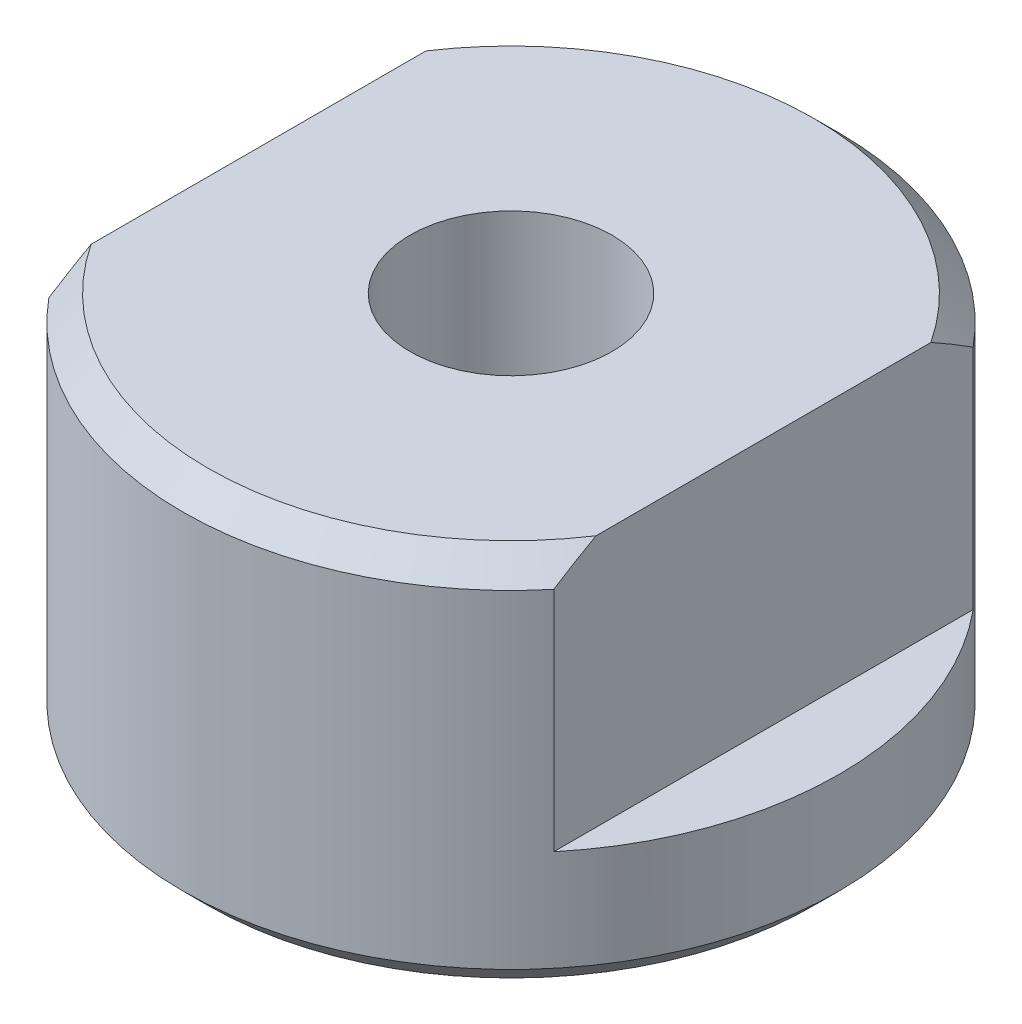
ISO-10303-21;
HEADER;
FILE_DESCRIPTION(('STEP AP214'),'2;1');
FILE_NAME('part.step','',(''),(''),'','','');
FILE_SCHEMA(('AUTOMOTIVE_DESIGN { 1 0 10303 214 1 1 1 1 }'));
ENDSEC;
DATA;
#1=APPLICATION_CONTEXT('core data for automotive mechanical design processes');
#2=APPLICATION_PROTOCOL_DEFINITION('international standard','automotive_design',2000,#1);
#3=PRODUCT_CONTEXT('',#1,'mechanical');
#4=PRODUCT('Part','Part','',(#3));
#5=PRODUCT_RELATED_PRODUCT_CATEGORY('part','',(#4));
#6=PRODUCT_DEFINITION_FORMATION('','',#4);
#7=PRODUCT_DEFINITION_CONTEXT('part definition',#1,'design');
#8=PRODUCT_DEFINITION('design','',#6,#7);
#9=PRODUCT_DEFINITION_SHAPE('','',#8);
#10=(LENGTH_UNIT() NAMED_UNIT(*) SI_UNIT(.MILLI.,.METRE.));
#11=(NAMED_UNIT(*) PLANE_ANGLE_UNIT() SI_UNIT($,.RADIAN.));
#12=(NAMED_UNIT(*) SI_UNIT($,.STERADIAN.) SOLID_ANGLE_UNIT());
#13=UNCERTAINTY_MEASURE_WITH_UNIT(LENGTH_MEASURE(1.E-05),#10,'distance_accuracy_value','');
#14=(GEOMETRIC_REPRESENTATION_CONTEXT(3) GLOBAL_UNCERTAINTY_ASSIGNED_CONTEXT((#13)) GLOBAL_UNIT_ASSIGNED_CONTEXT((#10,
#11,#12)) REPRESENTATION_CONTEXT('',''));
#15=CARTESIAN_POINT('',(0.,0.,0.));
#16=DIRECTION('',(0.,0.,1.));
#17=DIRECTION('',(1.,0.,0.));
#18=AXIS2_PLACEMENT_3D('',#15,#16,#17);
#19=CARTESIAN_POINT('',(56.,-2.59999999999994,1.65));
#20=DIRECTION('',(0.,-1.,0.));
#21=DIRECTION('',(0.,0.,-1.));
#22=AXIS2_PLACEMENT_3D('',#19,#20,#21);
#23=CONICAL_SURFACE('',#22,2.6,0.785398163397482);
#24=CARTESIAN_POINT('',(54.,-4.16968255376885,5.30872280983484));
#25=CARTESIAN_POINT('',(54.,-4.07553205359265,5.20138421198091));
#26=CARTESIAN_POINT('',(54.,-3.98187869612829,5.09360097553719));
#27=CARTESIAN_POINT('',(54.,-3.79592223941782,4.876795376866));
#28=CARTESIAN_POINT('',(54.,-3.70361974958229,4.76777249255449));
#29=CARTESIAN_POINT('',(54.,-3.51901631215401,4.54608422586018));
#30=CARTESIAN_POINT('',(54.,-3.42675070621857,4.43338930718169));
#31=CARTESIAN_POINT('',(54.,-3.24476216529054,4.20600054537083));
#32=CARTESIAN_POINT('',(54.,-3.15503861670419,4.09130719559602));
#33=CARTESIAN_POINT('',(54.,-2.97901219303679,3.8591314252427));
#34=CARTESIAN_POINT('',(54.,-2.89271276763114,3.74164637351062));
#35=CARTESIAN_POINT('',(54.,-2.72512031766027,3.502976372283));
#36=CARTESIAN_POINT('',(54.,-2.64383124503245,3.38178861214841));
#37=CARTESIAN_POINT('',(54.,-2.48934435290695,3.13527397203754));
#38=CARTESIAN_POINT('',(54.,-2.41610274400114,3.00997486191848));
#39=CARTESIAN_POINT('',(54.,-2.28145924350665,2.75317123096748));
#40=CARTESIAN_POINT('',(54.,-2.22003710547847,2.62167781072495));
#41=CARTESIAN_POINT('',(54.,-2.14123847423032,2.41742619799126));
#42=CARTESIAN_POINT('',(54.,-2.11699806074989,2.34733288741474));
#43=CARTESIAN_POINT('',(54.,-2.07455687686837,2.20531742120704));
#44=CARTESIAN_POINT('',(54.,-2.05635516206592,2.13339555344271));
#45=CARTESIAN_POINT('',(54.,-2.02723942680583,1.98864167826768));
#46=CARTESIAN_POINT('',(54.,-2.01627012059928,1.91582101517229));
#47=CARTESIAN_POINT('',(54.,-2.0022380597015,1.76941657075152));
#48=CARTESIAN_POINT('',(54.,-1.9991738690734,1.69583293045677));
#49=CARTESIAN_POINT('',(54.,-2.00121401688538,1.54845938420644));
#50=CARTESIAN_POINT('',(54.,-2.00635415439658,1.47466998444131));
#51=CARTESIAN_POINT('',(54.,-2.02443707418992,1.32805953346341));
#52=CARTESIAN_POINT('',(54.,-2.03738167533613,1.25523871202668));
#53=CARTESIAN_POINT('',(54.,-2.07025452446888,1.11059020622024));
#54=CARTESIAN_POINT('',(54.,-2.09023951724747,1.03877567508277));
#55=CARTESIAN_POINT('',(54.,-2.13598816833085,0.897039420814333));
#56=CARTESIAN_POINT('',(54.,-2.16175219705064,0.827117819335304));
#57=CARTESIAN_POINT('',(54.,-2.22233429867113,0.678358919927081));
#58=CARTESIAN_POINT('',(54.,-2.25793879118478,0.599845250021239));
#59=CARTESIAN_POINT('',(54.,-2.33391268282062,0.445138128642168));
#60=CARTESIAN_POINT('',(54.,-2.37428472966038,0.368945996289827));
#61=CARTESIAN_POINT('',(54.,-2.45874054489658,0.218466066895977));
#62=CARTESIAN_POINT('',(54.,-2.50283150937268,0.144182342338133));
#63=CARTESIAN_POINT('',(54.,-2.59380849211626,-0.00262172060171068));
#64=CARTESIAN_POINT('',(54.,-2.64069397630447,-0.0751423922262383));
#65=CARTESIAN_POINT('',(54.,-2.73691638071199,-0.219115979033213));
#66=CARTESIAN_POINT('',(54.,-2.78626548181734,-0.29056071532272));
#67=CARTESIAN_POINT('',(54.,-2.88671424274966,-0.432211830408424));
#68=CARTESIAN_POINT('',(54.,-2.93781403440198,-0.502418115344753));
#69=CARTESIAN_POINT('',(54.,-3.09307406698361,-0.711318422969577));
#70=CARTESIAN_POINT('',(54.,-3.19931228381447,-0.848465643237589));
#71=CARTESIAN_POINT('',(54.,-3.44738497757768,-1.15994024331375));
#72=CARTESIAN_POINT('',(54.,-3.59045776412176,-1.3332727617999));
#73=CARTESIAN_POINT('',(54.,-3.80700708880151,-1.5896477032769));
#74=CARTESIAN_POINT('',(54.,-3.87901711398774,-1.67394045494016));
#75=CARTESIAN_POINT('',(54.,-4.02380657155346,-1.84182232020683));
#76=CARTESIAN_POINT('',(54.,-4.09658578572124,-1.92541162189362));
#77=CARTESIAN_POINT('',(54.,-4.16968255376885,-2.00872280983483));
#78=B_SPLINE_CURVE_WITH_KNOTS('',3,(#24,#25,#26,#27,#28,#29,#30,#31,#32,#33,#34,#35,#36,#37,#38,
#39,#40,#41,#42,#43,#44,#45,#46,#47,#48,#49,#50,#51,#52,#53,#54,#55,#56,#57,#58,#59,#60,#61,#62,
#63,#64,#65,#66,#67,#68,#69,#70,#71,#72,#73,#74,#75,#76,#77),.UNSPECIFIED.,.F.,.F.,(4,2,2,2,2,2,
2,2,2,2,2,2,2,2,2,2,2,2,2,2,2,2,2,2,2,2,4),(0.,0.428345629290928,0.856878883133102,
1.29379390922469,1.73060255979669,2.16784064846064,2.60541930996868,3.04048480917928,
3.47479828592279,3.69708380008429,3.9193345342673,4.13986601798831,4.36035744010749,
4.58181359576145,4.80332138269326,5.02665696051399,5.25000685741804,5.50842088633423,
5.76697910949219,6.02604965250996,6.28507084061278,6.54553222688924,6.80601326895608,
7.32635191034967,8.0005201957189,8.33310775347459,8.66560336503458),.UNSPECIFIED.);
#79=CARTESIAN_POINT('',(54.,-2.59999999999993,3.31132477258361));
#80=VERTEX_POINT('',#79);
#81=CARTESIAN_POINT('',(54.,-2.3999999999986,2.97664991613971));
#82=VERTEX_POINT('',#81);
#83=EDGE_CURVE('E11',#80,#82,#78,.T.);
#84=ORIENTED_EDGE('',*,*,#83,.F.);
#85=CARTESIAN_POINT('',(56.,-2.59999999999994,1.65));
#86=DIRECTION('',(0.,1.,0.));
#87=DIRECTION('',(0.,0.,1.));
#88=AXIS2_PLACEMENT_3D('',#85,#86,#87);
#89=CIRCLE('',#88,2.6);
#90=CARTESIAN_POINT('',(58.,-2.59999999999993,3.31132477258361));
#91=VERTEX_POINT('',#90);
#92=EDGE_CURVE('E111',#91,#80,#89,.F.);
#93=ORIENTED_EDGE('',*,*,#92,.F.);
#94=CARTESIAN_POINT('',(58.,-4.16968255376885,-2.00872280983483));
#95=CARTESIAN_POINT('',(58.,-4.07553205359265,-1.90138421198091));
#96=CARTESIAN_POINT('',(58.,-3.98187869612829,-1.79360097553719));
#97=CARTESIAN_POINT('',(58.,-3.79592223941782,-1.576795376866));
#98=CARTESIAN_POINT('',(58.,-3.70361974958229,-1.46777249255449));
#99=CARTESIAN_POINT('',(58.,-3.51901631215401,-1.24608422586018));
#100=CARTESIAN_POINT('',(58.,-3.42675070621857,-1.13338930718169));
#101=CARTESIAN_POINT('',(58.,-3.24476216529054,-0.906000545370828));
#102=CARTESIAN_POINT('',(58.,-3.15503861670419,-0.79130719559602));
#103=CARTESIAN_POINT('',(58.,-2.97901219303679,-0.559131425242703));
#104=CARTESIAN_POINT('',(58.,-2.89271276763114,-0.441646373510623));
#105=CARTESIAN_POINT('',(58.,-2.72512031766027,-0.202976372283));
#106=CARTESIAN_POINT('',(58.,-2.64383124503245,-0.081788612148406));
#107=CARTESIAN_POINT('',(58.,-2.48934435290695,0.164726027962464));
#108=CARTESIAN_POINT('',(58.,-2.41610274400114,0.290025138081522));
#109=CARTESIAN_POINT('',(58.,-2.28145924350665,0.546828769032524));
#110=CARTESIAN_POINT('',(58.,-2.22003710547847,0.678322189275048));
#111=CARTESIAN_POINT('',(58.,-2.14123847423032,0.882573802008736));
#112=CARTESIAN_POINT('',(58.,-2.11699806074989,0.952667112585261));
#113=CARTESIAN_POINT('',(58.,-2.07455687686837,1.09468257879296));
#114=CARTESIAN_POINT('',(58.,-2.05635516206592,1.16660444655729));
#115=CARTESIAN_POINT('',(58.,-2.02723942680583,1.31135832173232));
#116=CARTESIAN_POINT('',(58.,-2.01627012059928,1.38417898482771));
#117=CARTESIAN_POINT('',(58.,-2.0022380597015,1.53058342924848));
#118=CARTESIAN_POINT('',(58.,-1.9991738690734,1.60416706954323));
#119=CARTESIAN_POINT('',(58.,-2.00121401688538,1.75154061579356));
#120=CARTESIAN_POINT('',(58.,-2.00635415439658,1.82533001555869));
#121=CARTESIAN_POINT('',(58.,-2.02443707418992,1.97194046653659));
#122=CARTESIAN_POINT('',(58.,-2.03738167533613,2.04476128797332));
#123=CARTESIAN_POINT('',(58.,-2.07025452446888,2.18940979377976));
#124=CARTESIAN_POINT('',(58.,-2.09023951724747,2.26122432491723));
#125=CARTESIAN_POINT('',(58.,-2.13598816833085,2.40296057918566));
#126=CARTESIAN_POINT('',(58.,-2.16175219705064,2.47288218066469));
#127=CARTESIAN_POINT('',(58.,-2.22233429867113,2.62164108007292));
#128=CARTESIAN_POINT('',(58.,-2.25793879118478,2.70015474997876));
#129=CARTESIAN_POINT('',(58.,-2.33391268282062,2.85486187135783));
#130=CARTESIAN_POINT('',(58.,-2.37428472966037,2.93105400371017));
#131=CARTESIAN_POINT('',(58.,-2.45874054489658,3.08153393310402));
#132=CARTESIAN_POINT('',(58.,-2.50283150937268,3.15581765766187));
#133=CARTESIAN_POINT('',(58.,-2.59380849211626,3.30262172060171));
#134=CARTESIAN_POINT('',(58.,-2.64069397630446,3.37514239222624));
#135=CARTESIAN_POINT('',(58.,-2.73691638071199,3.51911597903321));
#136=CARTESIAN_POINT('',(58.,-2.78626548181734,3.59056071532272));
#137=CARTESIAN_POINT('',(58.,-2.88671424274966,3.73221183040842));
#138=CARTESIAN_POINT('',(58.,-2.93781403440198,3.80241811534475));
#139=CARTESIAN_POINT('',(58.,-3.09307406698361,4.01131842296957));
#140=CARTESIAN_POINT('',(58.,-3.19931228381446,4.14846564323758));
#141=CARTESIAN_POINT('',(58.,-3.44738497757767,4.45994024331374));
#142=CARTESIAN_POINT('',(58.,-3.59045776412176,4.6332727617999));
#143=CARTESIAN_POINT('',(58.,-3.80700708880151,4.8896477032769));
#144=CARTESIAN_POINT('',(58.,-3.87901711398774,4.97394045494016));
#145=CARTESIAN_POINT('',(58.,-4.02380657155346,5.14182232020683));
#146=CARTESIAN_POINT('',(58.,-4.09658578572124,5.22541162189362));
#147=CARTESIAN_POINT('',(58.,-4.16968255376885,5.30872280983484));
#148=B_SPLINE_CURVE_WITH_KNOTS('',3,(#94,#95,#96,#97,#98,#99,#100,#101,#102,#103,#104,#105,#106,
#107,#108,#109,#110,#111,#112,#113,#114,#115,#116,#117,#118,#119,#120,#121,#122,#123,#124,#125,
#126,#127,#128,#129,#130,#131,#132,#133,#134,#135,#136,#137,#138,#139,#140,#141,#142,#143,#144,
#145,#146,#147),.UNSPECIFIED.,.F.,.F.,(4,2,2,2,2,2,2,2,2,2,2,2,2,2,2,2,2,2,2,2,2,2,2,2,2,2,4),
(0.,0.428345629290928,0.856878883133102,1.29379390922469,1.73060255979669,2.16784064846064,
2.60541930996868,3.04048480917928,3.47479828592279,3.69708380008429,3.9193345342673,
4.1398660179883,4.36035744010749,4.58181359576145,4.80332138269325,5.02665696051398,
5.25000685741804,5.50842088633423,5.76697910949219,6.02604965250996,6.28507084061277,
6.54553222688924,6.80601326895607,7.32635191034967,8.0005201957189,8.33310775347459,
8.66560336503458),.UNSPECIFIED.);
#149=CARTESIAN_POINT('',(58.,-2.3999999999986,2.97664991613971));
#150=VERTEX_POINT('',#149);
#151=EDGE_CURVE('E146',#150,#91,#148,.T.);
#152=ORIENTED_EDGE('',*,*,#151,.F.);
#153=CARTESIAN_POINT('',(56.,-2.3999999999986,1.65));
#154=DIRECTION('',(0.,1.,0.));
#155=DIRECTION('',(0.,0.,1.));
#156=AXIS2_PLACEMENT_3D('',#153,#154,#155);
#157=CIRCLE('',#156,2.39999999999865);
#158=EDGE_CURVE('E143',#82,#150,#157,.T.);
#159=ORIENTED_EDGE('',*,*,#158,.F.);
#160=EDGE_LOOP('',(#84,#93,#152,#159));
#161=FACE_BOUND('',#160,.T.);
#162=ADVANCED_FACE('F35',(#161),#23,.T.);
#163=CARTESIAN_POINT('',(58.6,-5.4,1.65));
#164=DIRECTION('',(0.,-1.,0.));
#165=DIRECTION('',(0.,0.,-1.));
#166=AXIS2_PLACEMENT_3D('',#163,#164,#165);
#167=PLANE('',#166);
#168=CARTESIAN_POINT('',(56.,-5.4,1.65));
#169=DIRECTION('',(0.,-1.,0.));
#170=DIRECTION('',(0.,0.,-1.));
#171=AXIS2_PLACEMENT_3D('',#168,#169,#170);
#172=CIRCLE('',#171,2.40000000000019);
#173=CARTESIAN_POINT('',(56.,-5.4,4.05000000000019));
#174=VERTEX_POINT('',#173);
#175=EDGE_CURVE('E135',#174,#174,#172,.T.);
#176=ORIENTED_EDGE('',*,*,#175,.T.);
#177=EDGE_LOOP('',(#176));
#178=FACE_BOUND('',#177,.T.);
#179=CARTESIAN_POINT('',(56.,-5.4,1.65));
#180=DIRECTION('',(0.,-1.,0.));
#181=DIRECTION('',(0.,0.,-1.));
#182=AXIS2_PLACEMENT_3D('',#179,#180,#181);
#183=CIRCLE('',#182,1.025);
#184=CARTESIAN_POINT('',(56.,-5.4,0.625000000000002));
#185=VERTEX_POINT('',#184);
#186=EDGE_CURVE('E113',#185,#185,#183,.T.);
#187=ORIENTED_EDGE('',*,*,#186,.F.);
#188=EDGE_LOOP('',(#187));
#189=FACE_BOUND('',#188,.T.);
#190=ADVANCED_FACE('F174',(#178,#189),#167,.T.);
#191=CARTESIAN_POINT('',(56.,-1065.45754338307,1.65));
#192=DIRECTION('',(0.,-1.,0.));
#193=DIRECTION('',(0.,0.,-1.));
#194=AXIS2_PLACEMENT_3D('',#191,#192,#193);
#195=CYLINDRICAL_SURFACE('',#194,2.6);
#196=DIRECTION('',(0.,1.,0.));
#197=VECTOR('',#196,1.);
#198=CARTESIAN_POINT('',(54.,-4.3999999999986,3.31132477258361));
#199=LINE('',#198,#197);
#200=CARTESIAN_POINT('',(54.,-4.3999999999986,3.31132477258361));
#201=VERTEX_POINT('',#200);
#202=EDGE_CURVE('E102',#201,#80,#199,.T.);
#203=ORIENTED_EDGE('',*,*,#202,.F.);
#204=CARTESIAN_POINT('',(56.,-4.3999999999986,1.65));
#205=DIRECTION('',(0.,1.,0.));
#206=DIRECTION('',(0.,0.,1.));
#207=AXIS2_PLACEMENT_3D('',#204,#205,#206);
#208=CIRCLE('',#207,2.6);
#209=CARTESIAN_POINT('',(54.,-4.3999999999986,-0.0113247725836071));
#210=VERTEX_POINT('',#209);
#211=EDGE_CURVE('E93',#210,#201,#208,.T.);
#212=ORIENTED_EDGE('',*,*,#211,.F.);
#213=DIRECTION('',(0.,1.,0.));
#214=VECTOR('',#213,1.);
#215=CARTESIAN_POINT('',(54.,-4.3999999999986,-0.0113247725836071));
#216=LINE('',#215,#214);
#217=CARTESIAN_POINT('',(54.,-2.59999999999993,-0.0113247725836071));
#218=VERTEX_POINT('',#217);
#219=EDGE_CURVE('E104',#210,#218,#216,.T.);
#220=ORIENTED_EDGE('',*,*,#219,.T.);
#221=CARTESIAN_POINT('',(58.,-2.59999999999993,-0.0113247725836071));
#222=VERTEX_POINT('',#221);
#223=EDGE_CURVE('E139',#218,#222,#89,.F.);
#224=ORIENTED_EDGE('',*,*,#223,.T.);
#225=DIRECTION('',(0.,1.,0.));
#226=VECTOR('',#225,1.);
#227=CARTESIAN_POINT('',(58.,-4.3999999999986,-0.0113247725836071));
#228=LINE('',#227,#226);
#229=CARTESIAN_POINT('',(58.,-4.3999999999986,-0.0113247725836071));
#230=VERTEX_POINT('',#229);
#231=EDGE_CURVE('E122',#230,#222,#228,.T.);
#232=ORIENTED_EDGE('',*,*,#231,.F.);
#233=CARTESIAN_POINT('',(56.,-4.3999999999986,1.65));
#234=DIRECTION('',(0.,1.,0.));
#235=DIRECTION('',(0.,0.,1.));
#236=AXIS2_PLACEMENT_3D('',#233,#234,#235);
#237=CIRCLE('',#236,2.6);
#238=CARTESIAN_POINT('',(58.,-4.3999999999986,3.31132477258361));
#239=VERTEX_POINT('',#238);
#240=EDGE_CURVE('E117',#239,#230,#237,.T.);
#241=ORIENTED_EDGE('',*,*,#240,.F.);
#242=DIRECTION('',(0.,1.,0.));
#243=VECTOR('',#242,1.);
#244=CARTESIAN_POINT('',(58.,-4.3999999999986,3.31132477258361));
#245=LINE('',#244,#243);
#246=EDGE_CURVE('E124',#239,#91,#245,.T.);
#247=ORIENTED_EDGE('',*,*,#246,.T.);
#248=ORIENTED_EDGE('',*,*,#92,.T.);
#249=EDGE_LOOP('',(#203,#212,#220,#224,#232,#241,#247,#248));
#250=FACE_BOUND('',#249,.T.);
#251=CARTESIAN_POINT('',(56.,-5.20000000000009,1.65));
#252=DIRECTION('',(0.,-1.,0.));
#253=DIRECTION('',(0.,0.,-1.));
#254=AXIS2_PLACEMENT_3D('',#251,#252,#253);
#255=CIRCLE('',#254,2.6);
#256=CARTESIAN_POINT('',(56.,-5.20000000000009,4.25));
#257=VERTEX_POINT('',#256);
#258=EDGE_CURVE('E140',#257,#257,#255,.F.);
#259=ORIENTED_EDGE('',*,*,#258,.T.);
#260=EDGE_LOOP('',(#259));
#261=FACE_BOUND('',#260,.T.);
#262=ADVANCED_FACE('F107',(#250,#261),#195,.T.);
#263=CARTESIAN_POINT('',(58.6,-2.3999999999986,1.65));
#264=DIRECTION('',(0.,1.,0.));
#265=DIRECTION('',(0.,0.,1.));
#266=AXIS2_PLACEMENT_3D('',#263,#264,#265);
#267=PLANE('',#266);
#268=DIRECTION('',(0.,0.,-1.));
#269=VECTOR('',#268,1.);
#270=CARTESIAN_POINT('',(54.,-2.3999999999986,-0.0113247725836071));
#271=LINE('',#270,#269);
#272=CARTESIAN_POINT('',(54.,-2.3999999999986,0.323350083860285));
#273=VERTEX_POINT('',#272);
#274=EDGE_CURVE('E55',#82,#273,#271,.T.);
#275=ORIENTED_EDGE('',*,*,#274,.F.);
#276=ORIENTED_EDGE('',*,*,#158,.T.);
#277=DIRECTION('',(0.,0.,1.));
#278=VECTOR('',#277,1.);
#279=CARTESIAN_POINT('',(58.,-2.3999999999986,3.31132477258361));
#280=LINE('',#279,#278);
#281=CARTESIAN_POINT('',(58.,-2.3999999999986,0.323350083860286));
#282=VERTEX_POINT('',#281);
#283=EDGE_CURVE('E63',#282,#150,#280,.T.);
#284=ORIENTED_EDGE('',*,*,#283,.F.);
#285=EDGE_CURVE('E145',#282,#273,#157,.T.);
#286=ORIENTED_EDGE('',*,*,#285,.T.);
#287=EDGE_LOOP('',(#275,#276,#284,#286));
#288=FACE_BOUND('',#287,.T.);
#289=CARTESIAN_POINT('',(56.,-2.39999999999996,1.65));
#290=DIRECTION('',(0.,-1.,0.));
#291=DIRECTION('',(0.,0.,-1.));
#292=AXIS2_PLACEMENT_3D('',#289,#290,#291);
#293=CIRCLE('',#292,0.800000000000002);
#294=CARTESIAN_POINT('',(56.,-2.39999999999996,0.849999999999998));
#295=VERTEX_POINT('',#294);
#296=EDGE_CURVE('E132',#295,#295,#293,.T.);
#297=ORIENTED_EDGE('',*,*,#296,.T.);
#298=EDGE_LOOP('',(#297));
#299=FACE_BOUND('',#298,.T.);
#300=ADVANCED_FACE('F167',(#288,#299),#267,.T.);
#301=CARTESIAN_POINT('',(56.,-5.4,1.65));
#302=DIRECTION('',(0.,-1.,0.));
#303=DIRECTION('',(0.,0.,-1.));
#304=AXIS2_PLACEMENT_3D('',#301,#302,#303);
#305=CYLINDRICAL_SURFACE('',#304,0.800000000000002);
#306=ORIENTED_EDGE('',*,*,#296,.F.);
#307=EDGE_LOOP('',(#306));
#308=FACE_BOUND('',#307,.T.);
#309=CARTESIAN_POINT('',(56.,-5.175,1.65));
#310=DIRECTION('',(0.,-1.,0.));
#311=DIRECTION('',(0.,0.,-1.));
#312=AXIS2_PLACEMENT_3D('',#309,#310,#311);
#313=CIRCLE('',#312,0.800000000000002);
#314=CARTESIAN_POINT('',(56.,-5.175,0.849999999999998));
#315=VERTEX_POINT('',#314);
#316=EDGE_CURVE('E129',#315,#315,#313,.T.);
#317=ORIENTED_EDGE('',*,*,#316,.T.);
#318=EDGE_LOOP('',(#317));
#319=FACE_BOUND('',#318,.T.);
#320=ADVANCED_FACE('F163',(#308,#319),#305,.F.);
#321=CARTESIAN_POINT('',(56.,-5.4,1.65));
#322=DIRECTION('',(0.,-1.,0.));
#323=DIRECTION('',(0.,0.,-1.));
#324=AXIS2_PLACEMENT_3D('',#321,#322,#323);
#325=CONICAL_SURFACE('',#324,1.025,0.785398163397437);
#326=ORIENTED_EDGE('',*,*,#316,.F.);
#327=EDGE_LOOP('',(#326));
#328=FACE_BOUND('',#327,.T.);
#329=ORIENTED_EDGE('',*,*,#186,.T.);
#330=EDGE_LOOP('',(#329));
#331=FACE_BOUND('',#330,.T.);
#332=ADVANCED_FACE('F159',(#328,#331),#325,.F.);
#333=CARTESIAN_POINT('',(56.,-5.40000000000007,1.65));
#334=DIRECTION('',(0.,1.,0.));
#335=DIRECTION('',(0.,0.,1.));
#336=AXIS2_PLACEMENT_3D('',#333,#334,#335);
#337=CONICAL_SURFACE('',#336,2.40000000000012,0.785398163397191);
#338=CARTESIAN_POINT('',(56.,-5.20000000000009,4.25));
#339=CARTESIAN_POINT('',(56.,-5.20208333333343,4.24791666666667));
#340=CARTESIAN_POINT('',(56.,-5.20416666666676,4.24583333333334));
#341=CARTESIAN_POINT('',(56.,-5.20833333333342,4.24166666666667));
#342=CARTESIAN_POINT('',(56.,-5.21041666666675,4.23958333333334));
#343=CARTESIAN_POINT('',(56.,-5.21458333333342,4.23541666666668));
#344=CARTESIAN_POINT('',(56.,-5.21666666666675,4.23333333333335));
#345=CARTESIAN_POINT('',(56.,-5.22083333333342,4.22916666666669));
#346=CARTESIAN_POINT('',(56.,-5.22291666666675,4.22708333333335));
#347=CARTESIAN_POINT('',(56.,-5.22708333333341,4.22291666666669));
#348=CARTESIAN_POINT('',(56.,-5.22916666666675,4.22083333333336));
#349=CARTESIAN_POINT('',(56.,-5.23333333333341,4.2166666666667));
#350=CARTESIAN_POINT('',(56.,-5.23541666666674,4.21458333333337));
#351=CARTESIAN_POINT('',(56.,-5.23958333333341,4.2104166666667));
#352=CARTESIAN_POINT('',(56.,-5.24166666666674,4.20833333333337));
#353=CARTESIAN_POINT('',(56.,-5.24583333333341,4.20416666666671));
#354=CARTESIAN_POINT('',(56.,-5.24791666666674,4.20208333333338));
#355=CARTESIAN_POINT('',(56.,-5.2520833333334,4.19791666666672));
#356=CARTESIAN_POINT('',(56.,-5.25416666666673,4.19583333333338));
#357=CARTESIAN_POINT('',(56.,-5.2583333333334,4.19166666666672));
#358=CARTESIAN_POINT('',(56.,-5.26041666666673,4.18958333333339));
#359=CARTESIAN_POINT('',(56.,-5.2645833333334,4.18541666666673));
#360=CARTESIAN_POINT('',(56.,-5.26666666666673,4.1833333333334));
#361=CARTESIAN_POINT('',(56.,-5.27083333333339,4.17916666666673));
#362=CARTESIAN_POINT('',(56.,-5.27291666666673,4.1770833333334));
#363=CARTESIAN_POINT('',(56.,-5.27708333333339,4.17291666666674));
#364=CARTESIAN_POINT('',(56.,-5.27916666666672,4.17083333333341));
#365=CARTESIAN_POINT('',(56.,-5.28333333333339,4.16666666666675));
#366=CARTESIAN_POINT('',(56.,-5.28541666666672,4.16458333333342));
#367=CARTESIAN_POINT('',(56.,-5.28958333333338,4.16041666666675));
#368=CARTESIAN_POINT('',(56.,-5.29166666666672,4.15833333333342));
#369=CARTESIAN_POINT('',(56.,-5.29583333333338,4.15416666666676));
#370=CARTESIAN_POINT('',(56.,-5.29791666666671,4.15208333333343));
#371=CARTESIAN_POINT('',(56.,-5.30208333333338,4.14791666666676));
#372=CARTESIAN_POINT('',(56.,-5.30416666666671,4.14583333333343));
#373=CARTESIAN_POINT('',(56.,-5.30833333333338,4.14166666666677));
#374=CARTESIAN_POINT('',(56.,-5.31041666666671,4.13958333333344));
#375=CARTESIAN_POINT('',(56.,-5.31458333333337,4.13541666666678));
#376=CARTESIAN_POINT('',(56.,-5.31666666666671,4.13333333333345));
#377=CARTESIAN_POINT('',(56.,-5.32083333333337,4.12916666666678));
#378=CARTESIAN_POINT('',(56.,-5.3229166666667,4.12708333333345));
#379=CARTESIAN_POINT('',(56.,-5.32708333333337,4.12291666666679));
#380=CARTESIAN_POINT('',(56.,-5.3291666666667,4.12083333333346));
#381=CARTESIAN_POINT('',(56.,-5.33333333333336,4.1166666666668));
#382=CARTESIAN_POINT('',(56.,-5.3354166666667,4.11458333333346));
#383=CARTESIAN_POINT('',(56.,-5.33958333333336,4.1104166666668));
#384=CARTESIAN_POINT('',(56.,-5.34166666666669,4.10833333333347));
#385=CARTESIAN_POINT('',(56.,-5.34583333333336,4.10416666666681));
#386=CARTESIAN_POINT('',(56.,-5.34791666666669,4.10208333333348));
#387=CARTESIAN_POINT('',(56.,-5.35208333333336,4.09791666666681));
#388=CARTESIAN_POINT('',(56.,-5.35416666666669,4.09583333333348));
#389=CARTESIAN_POINT('',(56.,-5.35833333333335,4.09166666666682));
#390=CARTESIAN_POINT('',(56.,-5.36041666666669,4.08958333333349));
#391=CARTESIAN_POINT('',(56.,-5.36458333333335,4.08541666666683));
#392=CARTESIAN_POINT('',(56.,-5.36666666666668,4.08333333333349));
#393=CARTESIAN_POINT('',(56.,-5.37083333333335,4.07916666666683));
#394=CARTESIAN_POINT('',(56.,-5.37291666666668,4.0770833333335));
#395=CARTESIAN_POINT('',(56.,-5.37708333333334,4.07291666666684));
#396=CARTESIAN_POINT('',(56.,-5.37916666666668,4.07083333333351));
#397=CARTESIAN_POINT('',(56.,-5.38333333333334,4.06666666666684));
#398=CARTESIAN_POINT('',(56.,-5.38541666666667,4.06458333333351));
#399=CARTESIAN_POINT('',(56.,-5.38958333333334,4.06041666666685));
#400=CARTESIAN_POINT('',(56.,-5.39166666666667,4.05833333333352));
#401=CARTESIAN_POINT('',(56.,-5.39583333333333,4.05416666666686));
#402=CARTESIAN_POINT('',(56.,-5.39791666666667,4.05208333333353));
#403=CARTESIAN_POINT('',(56.,-5.4,4.05000000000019));
#404=B_SPLINE_CURVE_WITH_KNOTS('',3,(#338,#339,#340,#341,#342,#343,#344,#345,#346,#347,#348,
#349,#350,#351,#352,#353,#354,#355,#356,#357,#358,#359,#360,#361,#362,#363,#364,#365,#366,#367,
#368,#369,#370,#371,#372,#373,#374,#375,#376,#377,#378,#379,#380,#381,#382,#383,#384,#385,#386,
#387,#388,#389,#390,#391,#392,#393,#394,#395,#396,#397,#398,#399,#400,#401,#402,#403),
.UNSPECIFIED.,.F.,.F.,(4,2,2,2,2,2,2,2,2,2,2,2,2,2,2,2,2,2,2,2,2,2,2,2,2,2,2,2,2,2,2,2,4),(0.,
0.00883883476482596,0.0176776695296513,0.0265165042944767,0.035355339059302,0.0441941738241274,
0.0530330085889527,0.0618718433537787,0.070710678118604,0.0795495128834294,0.0883883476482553,
0.0972271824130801,0.106066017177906,0.114904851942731,0.123743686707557,0.132582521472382,
0.141421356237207,0.150260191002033,0.159099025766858,0.167937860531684,0.176776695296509,
0.185615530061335,0.19445436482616,0.203293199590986,0.212132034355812,0.220970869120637,
0.229809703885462,0.238648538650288,0.247487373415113,0.256326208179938,0.265165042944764,
0.27400387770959,0.282842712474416),.UNSPECIFIED.);
#405=EDGE_CURVE('BSEAM162',#257,#174,#404,.T.);
#406=ORIENTED_EDGE('',*,*,#258,.F.);
#407=ORIENTED_EDGE('',*,*,#175,.F.);
#408=ORIENTED_EDGE('',*,*,#405,.T.);
#409=ORIENTED_EDGE('',*,*,#405,.F.);
#410=EDGE_LOOP('',(#406,#408,#407,#409));
#411=FACE_BOUND('',#410,.T.);
#412=ADVANCED_FACE('F162',(#411),#337,.T.);
#413=EDGE_CURVE('E40',#273,#218,#78,.T.);
#414=ORIENTED_EDGE('',*,*,#413,.F.);
#415=ORIENTED_EDGE('',*,*,#285,.F.);
#416=EDGE_CURVE('E152',#222,#282,#148,.T.);
#417=ORIENTED_EDGE('',*,*,#416,.F.);
#418=ORIENTED_EDGE('',*,*,#223,.F.);
#419=EDGE_LOOP('',(#414,#415,#417,#418));
#420=FACE_BOUND('',#419,.T.);
#421=ADVANCED_FACE('F37',(#420),#23,.T.);
#422=CARTESIAN_POINT('',(58.,-4.3999999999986,3.31132477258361));
#423=DIRECTION('',(-1.,0.,0.));
#424=DIRECTION('',(0.,0.,1.));
#425=AXIS2_PLACEMENT_3D('',#422,#423,#424);
#426=PLANE('',#425);
#427=ORIENTED_EDGE('',*,*,#416,.T.);
#428=ORIENTED_EDGE('',*,*,#283,.T.);
#429=ORIENTED_EDGE('',*,*,#151,.T.);
#430=ORIENTED_EDGE('',*,*,#246,.F.);
#431=DIRECTION('',(0.,0.,1.));
#432=VECTOR('',#431,1.);
#433=CARTESIAN_POINT('',(58.,-4.3999999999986,3.31132477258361));
#434=LINE('',#433,#432);
#435=EDGE_CURVE('E119',#230,#239,#434,.T.);
#436=ORIENTED_EDGE('',*,*,#435,.F.);
#437=ORIENTED_EDGE('',*,*,#231,.T.);
#438=EDGE_LOOP('',(#427,#428,#429,#430,#436,#437));
#439=FACE_BOUND('',#438,.T.);
#440=ADVANCED_FACE('F153',(#439),#426,.F.);
#441=CARTESIAN_POINT('',(56.,-4.3999999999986,1.65));
#442=DIRECTION('',(0.,1.,0.));
#443=DIRECTION('',(0.,0.,1.));
#444=AXIS2_PLACEMENT_3D('',#441,#442,#443);
#445=PLANE('',#444);
#446=ORIENTED_EDGE('',*,*,#240,.T.);
#447=ORIENTED_EDGE('',*,*,#435,.T.);
#448=EDGE_LOOP('',(#446,#447));
#449=FACE_BOUND('',#448,.T.);
#450=ADVANCED_FACE('F158',(#449),#445,.T.);
#451=CARTESIAN_POINT('',(54.,-4.3999999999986,-0.0113247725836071));
#452=DIRECTION('',(1.,0.,0.));
#453=DIRECTION('',(0.,0.,-1.));
#454=AXIS2_PLACEMENT_3D('',#451,#452,#453);
#455=PLANE('',#454);
#456=ORIENTED_EDGE('',*,*,#83,.T.);
#457=ORIENTED_EDGE('',*,*,#274,.T.);
#458=ORIENTED_EDGE('',*,*,#413,.T.);
#459=ORIENTED_EDGE('',*,*,#219,.F.);
#460=DIRECTION('',(0.,0.,-1.));
#461=VECTOR('',#460,1.);
#462=CARTESIAN_POINT('',(54.,-4.3999999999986,-0.0113247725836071));
#463=LINE('',#462,#461);
#464=EDGE_CURVE('E96',#201,#210,#463,.T.);
#465=ORIENTED_EDGE('',*,*,#464,.F.);
#466=ORIENTED_EDGE('',*,*,#202,.T.);
#467=EDGE_LOOP('',(#456,#457,#458,#459,#465,#466));
#468=FACE_BOUND('',#467,.T.);
#469=ADVANCED_FACE('F101',(#468),#455,.F.);
#470=CARTESIAN_POINT('',(56.,-4.3999999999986,1.65));
#471=DIRECTION('',(0.,1.,0.));
#472=DIRECTION('',(0.,0.,1.));
#473=AXIS2_PLACEMENT_3D('',#470,#471,#472);
#474=PLANE('',#473);
#475=ORIENTED_EDGE('',*,*,#211,.T.);
#476=ORIENTED_EDGE('',*,*,#464,.T.);
#477=EDGE_LOOP('',(#475,#476));
#478=FACE_BOUND('',#477,.T.);
#479=ADVANCED_FACE('F95',(#478),#474,.T.);
#480=CLOSED_SHELL('',(#162,#190,#262,#300,#320,#332,#412,#421,#440,#450,#469,#479));
#481=MANIFOLD_SOLID_BREP('B2',#480);
#482=ADVANCED_BREP_SHAPE_REPRESENTATION('',(#18,#481),#14);
#483=SHAPE_DEFINITION_REPRESENTATION(#9,#482);
ENDSEC;
END-ISO-10303-21;
